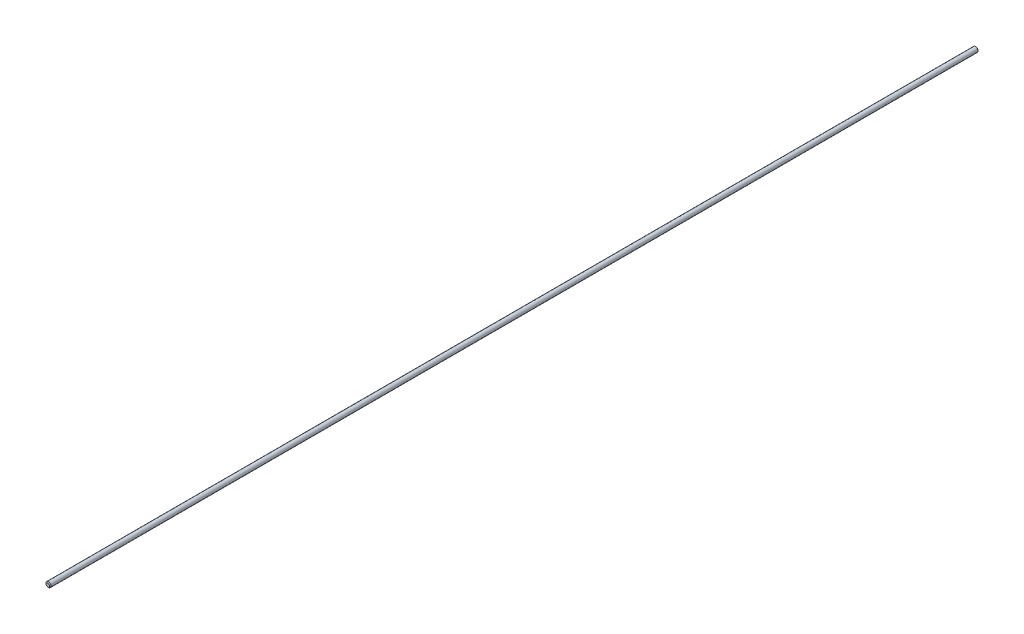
from build123d import *

# Parameters (mm, degrees)
BOSS_EXTRUDE1_DEPTH      = 584.2
BOSS_EXTRUDE1_DEPTH_BACK = 584.2
SKETCH4_R                = 3.175
CHAMFER1_SIZE            = 0.9525


with BuildPart() as part:
    # Sketch4 → Boss-Extrude1 (new, two sides: drawn at the far end of the back side and taken through both)
    with BuildSketch(Plane.XY.offset(-BOSS_EXTRUDE1_DEPTH_BACK)):
        Circle(SKETCH4_R)
    extrude(amount=BOSS_EXTRUDE1_DEPTH + BOSS_EXTRUDE1_DEPTH_BACK)

    # Chamfer1
    chamfer1_edges = [part.edges().sort_by_distance(p)[0] for p in [
        (-3.175, 0, -584.2),
        (-3.175, 0, 584.2),
    ]]
    chamfer(chamfer1_edges, length=CHAMFER1_SIZE)


solid = part.part
